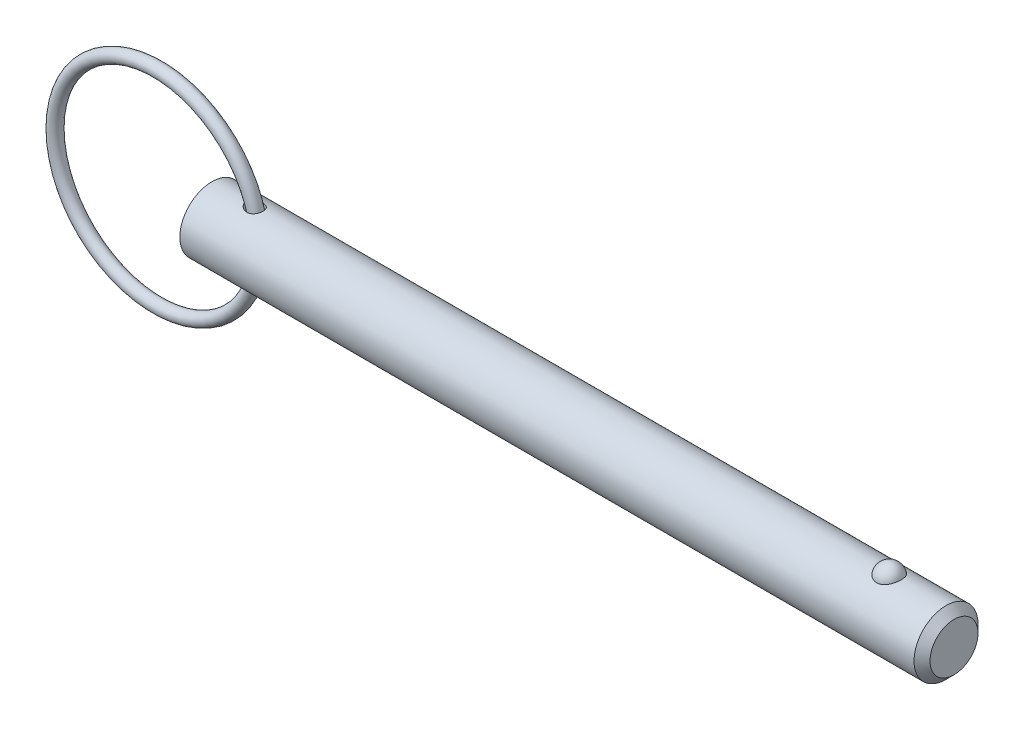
ISO-10303-21;
HEADER;
FILE_DESCRIPTION(('STEP AP214'),'2;1');
FILE_NAME('part.step','',(''),(''),'','','');
FILE_SCHEMA(('AUTOMOTIVE_DESIGN { 1 0 10303 214 1 1 1 1 }'));
ENDSEC;
DATA;
#1=APPLICATION_CONTEXT('core data for automotive mechanical design processes');
#2=APPLICATION_PROTOCOL_DEFINITION('international standard','automotive_design',2000,#1);
#3=PRODUCT_CONTEXT('',#1,'mechanical');
#4=PRODUCT('Part','Part','',(#3));
#5=PRODUCT_RELATED_PRODUCT_CATEGORY('part','',(#4));
#6=PRODUCT_DEFINITION_FORMATION('','',#4);
#7=PRODUCT_DEFINITION_CONTEXT('part definition',#1,'design');
#8=PRODUCT_DEFINITION('design','',#6,#7);
#9=PRODUCT_DEFINITION_SHAPE('','',#8);
#10=(LENGTH_UNIT() NAMED_UNIT(*) SI_UNIT(.MILLI.,.METRE.));
#11=(NAMED_UNIT(*) PLANE_ANGLE_UNIT() SI_UNIT($,.RADIAN.));
#12=(NAMED_UNIT(*) SI_UNIT($,.STERADIAN.) SOLID_ANGLE_UNIT());
#13=UNCERTAINTY_MEASURE_WITH_UNIT(LENGTH_MEASURE(1.E-05),#10,'distance_accuracy_value','');
#14=(GEOMETRIC_REPRESENTATION_CONTEXT(3) GLOBAL_UNCERTAINTY_ASSIGNED_CONTEXT((#13)) GLOBAL_UNIT_ASSIGNED_CONTEXT((#10,
#11,#12)) REPRESENTATION_CONTEXT('',''));
#15=CARTESIAN_POINT('',(0.,0.,0.));
#16=DIRECTION('',(0.,0.,1.));
#17=DIRECTION('',(1.,0.,0.));
#18=AXIS2_PLACEMENT_3D('',#15,#16,#17);
#19=CARTESIAN_POINT('',(-6.75433730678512,0.,0.));
#20=DIRECTION('',(0.,0.,1.));
#21=DIRECTION('',(1.,0.,0.));
#22=AXIS2_PLACEMENT_3D('',#19,#20,#21);
#23=TOROIDAL_SURFACE('',#22,12.7,0.794);
#24=CARTESIAN_POINT('',(6.73966269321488,0.,0.));
#25=VERTEX_POINT('',#24);
#26=VERTEX_LOOP('',#25);
#27=FACE_BOUND('',#26,.T.);
#28=ADVANCED_FACE('P0_F12',(#27),#23,.T.);
#29=CLOSED_SHELL('',(#28));
#30=MANIFOLD_SOLID_BREP('P0_B1',#29);
#31=CARTESIAN_POINT('',(0.,0.,0.));
#32=DIRECTION('',(1.,0.,0.));
#33=DIRECTION('',(0.,0.,-1.));
#34=AXIS2_PLACEMENT_3D('',#31,#32,#33);
#35=CYLINDRICAL_SURFACE('',#34,3.97);
#36=CARTESIAN_POINT('',(4.47423598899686,3.9272127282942,-0.581291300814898));
#37=CARTESIAN_POINT('',(4.51402362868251,3.92000695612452,-0.62997219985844));
#38=CARTESIAN_POINT('',(4.55825642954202,3.91241085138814,-0.675032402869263));
#39=CARTESIAN_POINT('',(4.65378532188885,3.8973704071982,-0.757069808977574));
#40=CARTESIAN_POINT('',(4.70509780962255,3.88992646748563,-0.794027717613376));
#41=CARTESIAN_POINT('',(4.81300878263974,3.87608600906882,-0.859045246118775));
#42=CARTESIAN_POINT('',(4.86959180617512,3.86968656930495,-0.887129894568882));
#43=CARTESIAN_POINT('',(4.98666757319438,3.85867771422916,-0.933854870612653));
#44=CARTESIAN_POINT('',(5.04715829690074,3.85406738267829,-0.952500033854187));
#45=CARTESIAN_POINT('',(5.17222686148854,3.84716625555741,-0.980011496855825));
#46=CARTESIAN_POINT('',(5.23687124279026,3.84494236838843,-0.988596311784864));
#47=CARTESIAN_POINT('',(5.36671178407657,3.84347581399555,-0.994286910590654));
#48=CARTESIAN_POINT('',(5.43190770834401,3.84423193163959,-0.991397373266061));
#49=CARTESIAN_POINT('',(5.5560514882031,3.84859691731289,-0.974304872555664));
#50=CARTESIAN_POINT('',(5.61511712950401,3.85200226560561,-0.960908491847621));
#51=CARTESIAN_POINT('',(5.72974412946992,3.8610605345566,-0.923836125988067));
#52=CARTESIAN_POINT('',(5.78530708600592,3.86671242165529,-0.90016486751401));
#53=CARTESIAN_POINT('',(5.88712740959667,3.87908259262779,-0.845190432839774));
#54=CARTESIAN_POINT('',(5.93376792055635,3.88569301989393,-0.814569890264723));
#55=CARTESIAN_POINT('',(6.02101503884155,3.89947732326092,-0.745789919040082));
#56=CARTESIAN_POINT('',(6.06162229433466,3.90665113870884,-0.707631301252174));
#57=CARTESIAN_POINT('',(6.13496290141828,3.9206013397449,-0.625680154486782));
#58=CARTESIAN_POINT('',(6.16783367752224,3.92738273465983,-0.582011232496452));
#59=CARTESIAN_POINT('',(6.2258925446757,3.93995609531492,-0.489706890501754));
#60=CARTESIAN_POINT('',(6.25108046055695,3.94574803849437,-0.441071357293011));
#61=CARTESIAN_POINT('',(6.29336449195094,3.95576358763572,-0.339770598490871));
#62=CARTESIAN_POINT('',(6.31039150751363,3.95997373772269,-0.28707520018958));
#63=CARTESIAN_POINT('',(6.33565624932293,3.96630600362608,-0.179496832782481));
#64=CARTESIAN_POINT('',(6.34389366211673,3.96842804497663,-0.124613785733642));
#65=CARTESIAN_POINT('',(6.35142037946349,3.97036465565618,-0.0138440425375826));
#66=CARTESIAN_POINT('',(6.35065227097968,3.97016441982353,0.0420468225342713));
#67=CARTESIAN_POINT('',(6.34004566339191,3.96744188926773,0.152904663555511));
#68=CARTESIAN_POINT('',(6.33020697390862,3.96491954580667,0.207871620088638));
#69=CARTESIAN_POINT('',(6.30166659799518,3.95782104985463,0.315369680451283));
#70=CARTESIAN_POINT('',(6.28295698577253,3.95324306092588,0.36789855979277));
#71=CARTESIAN_POINT('',(6.23710200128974,3.94253162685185,0.468965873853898));
#72=CARTESIAN_POINT('',(6.20995670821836,3.93639819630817,0.517504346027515));
#73=CARTESIAN_POINT('',(6.14798638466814,3.92327702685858,0.609041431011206));
#74=CARTESIAN_POINT('',(6.11318666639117,3.91629213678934,0.652057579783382));
#75=CARTESIAN_POINT('',(6.03675089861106,3.90223639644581,0.731492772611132));
#76=CARTESIAN_POINT('',(5.99511563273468,3.89516555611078,0.767912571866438));
#77=CARTESIAN_POINT('',(5.90657479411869,3.88180215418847,0.832828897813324));
#78=CARTESIAN_POINT('',(5.85972260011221,3.87550288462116,0.86139687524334));
#79=CARTESIAN_POINT('',(5.76177854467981,3.86429747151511,0.910350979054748));
#80=CARTESIAN_POINT('',(5.71068697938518,3.8593912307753,0.930737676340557));
#81=CARTESIAN_POINT('',(5.60571987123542,3.85147434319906,0.962976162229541));
#82=CARTESIAN_POINT('',(5.55184284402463,3.84846471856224,0.974823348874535));
#83=CARTESIAN_POINT('',(5.44283210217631,3.84460058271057,0.989953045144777));
#84=CARTESIAN_POINT('',(5.38769814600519,3.84374648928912,0.99323389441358));
#85=CARTESIAN_POINT('',(5.27524330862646,3.84420584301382,0.991454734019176));
#86=CARTESIAN_POINT('',(5.21792896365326,3.84561285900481,0.986034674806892));
#87=CARTESIAN_POINT('',(5.1048579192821,3.85052758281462,0.966661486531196));
#88=CARTESIAN_POINT('',(5.04910180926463,3.85403607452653,0.952705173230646));
#89=CARTESIAN_POINT('',(4.93593174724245,3.86308835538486,0.915340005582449));
#90=CARTESIAN_POINT('',(4.8787523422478,3.86877458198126,0.891254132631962));
#91=CARTESIAN_POINT('',(4.7690169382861,3.88143650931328,0.83438431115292));
#92=CARTESIAN_POINT('',(4.71646372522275,3.88841297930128,0.801595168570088));
#93=CARTESIAN_POINT('',(4.61492504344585,3.90324173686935,0.726056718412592));
#94=CARTESIAN_POINT('',(4.56625259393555,3.91112043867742,0.682888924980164));
#95=CARTESIAN_POINT('',(4.47749220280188,3.92644930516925,0.588370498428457));
#96=CARTESIAN_POINT('',(4.43740132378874,3.93389961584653,0.537022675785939));
#97=CARTESIAN_POINT('',(4.37035516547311,3.94686586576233,0.431042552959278));
#98=CARTESIAN_POINT('',(4.34268823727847,3.95247934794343,0.376876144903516));
#99=CARTESIAN_POINT('',(4.29855851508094,3.96161331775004,0.264011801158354));
#100=CARTESIAN_POINT('',(4.28207681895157,3.96513733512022,0.20532169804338));
#101=CARTESIAN_POINT('',(4.26319409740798,3.96919493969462,0.094762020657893));
#102=CARTESIAN_POINT('',(4.25904206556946,3.97009986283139,0.0432014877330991));
#103=CARTESIAN_POINT('',(4.26004223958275,3.9698827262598,-0.0598293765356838));
#104=CARTESIAN_POINT('',(4.26519288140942,3.96876100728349,-0.111299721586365));
#105=CARTESIAN_POINT('',(4.28369027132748,3.96479623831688,-0.208517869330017));
#106=CARTESIAN_POINT('',(4.29637416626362,3.96209263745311,-0.25440084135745));
#107=CARTESIAN_POINT('',(4.32867922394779,3.95536287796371,-0.343510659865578));
#108=CARTESIAN_POINT('',(4.34829584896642,3.95133758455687,-0.386739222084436));
#109=CARTESIAN_POINT('',(4.38573190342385,3.94389838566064,-0.455314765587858));
#110=CARTESIAN_POINT('',(4.40181371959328,3.94075686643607,-0.481662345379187));
#111=CARTESIAN_POINT('',(4.43632024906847,3.93417901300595,-0.532726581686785));
#112=CARTESIAN_POINT('',(4.45474473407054,3.93074270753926,-0.557443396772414));
#113=CARTESIAN_POINT('',(4.47423598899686,3.9272127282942,-0.581291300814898));
#114=B_SPLINE_CURVE_WITH_KNOTS('',3,(#36,#37,#38,#39,#40,#41,#42,#43,#44,#45,#46,#47,#48,#49,
#50,#51,#52,#53,#54,#55,#56,#57,#58,#59,#60,#61,#62,#63,#64,#65,#66,#67,#68,#69,#70,#71,#72,#73,
#74,#75,#76,#77,#78,#79,#80,#81,#82,#83,#84,#85,#86,#87,#88,#89,#90,#91,#92,#93,#94,#95,#96,#97,
#98,#99,#100,#101,#102,#103,#104,#105,#106,#107,#108,#109,#110,#111,#112,#113),.UNSPECIFIED.,
.T.,.F.,(4,2,2,2,2,2,2,2,2,2,2,2,2,2,2,2,2,2,2,2,2,2,2,2,2,2,2,2,2,2,2,2,2,2,2,2,2,2,4),(0.,
0.189730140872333,0.379907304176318,0.569543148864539,0.759081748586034,0.953805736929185,
1.148450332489,1.32946176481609,1.51039001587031,1.67812095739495,1.84583386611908,
2.01029437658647,2.17475863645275,2.34059186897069,2.50643101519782,2.67332801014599,
2.84022850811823,3.00727840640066,3.17432673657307,3.34083074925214,3.50731568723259,
3.67223129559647,3.83713539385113,4.00212829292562,4.16715316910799,4.33918465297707,
4.5112803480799,4.69738596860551,4.88360290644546,5.07919911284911,5.27472826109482,
5.45686425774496,5.63869168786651,5.79305070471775,5.94738377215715,6.08981233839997,
6.2321478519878,6.3251023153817,6.4180477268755),.UNSPECIFIED.);
#115=CARTESIAN_POINT('',(4.47423598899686,3.9272127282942,-0.581291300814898));
#116=VERTEX_POINT('',#115);
#117=EDGE_CURVE('P1_E40',#116,#116,#114,.T.);
#118=ORIENTED_EDGE('',*,*,#117,.T.);
#119=EDGE_LOOP('',(#118));
#120=FACE_BOUND('',#119,.T.);
#121=CARTESIAN_POINT('',(91.0875,0.,0.));
#122=DIRECTION('',(1.,0.,0.));
#123=DIRECTION('',(0.,0.,-1.));
#124=AXIS2_PLACEMENT_3D('',#121,#122,#123);
#125=CIRCLE('',#124,3.97);
#126=CARTESIAN_POINT('',(91.0875,0.,-3.97));
#127=VERTEX_POINT('',#126);
#128=EDGE_CURVE('P1_E25',#127,#127,#125,.T.);
#129=ORIENTED_EDGE('',*,*,#128,.F.);
#130=EDGE_LOOP('',(#129));
#131=FACE_BOUND('',#130,.T.);
#132=CARTESIAN_POINT('',(0.,0.,0.));
#133=DIRECTION('',(1.,0.,0.));
#134=DIRECTION('',(0.,0.,-1.));
#135=AXIS2_PLACEMENT_3D('',#132,#133,#134);
#136=CIRCLE('',#135,3.97);
#137=CARTESIAN_POINT('',(0.,0.,-3.97));
#138=VERTEX_POINT('',#137);
#139=EDGE_CURVE('P1_E9',#138,#138,#136,.T.);
#140=ORIENTED_EDGE('',*,*,#139,.T.);
#141=EDGE_LOOP('',(#140));
#142=FACE_BOUND('',#141,.T.);
#143=CARTESIAN_POINT('',(84.0451922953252,3.65715365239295,1.54470941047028));
#144=CARTESIAN_POINT('',(83.9652448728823,3.65716001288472,1.54470290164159));
#145=CARTESIAN_POINT('',(83.8851650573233,3.65987074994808,1.53832549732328));
#146=CARTESIAN_POINT('',(83.7272374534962,3.6704221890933,1.51297018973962));
#147=CARTESIAN_POINT('',(83.6493961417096,3.67827646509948,1.49395894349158));
#148=CARTESIAN_POINT('',(83.4984614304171,3.69818848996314,1.44395950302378));
#149=CARTESIAN_POINT('',(83.4253560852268,3.71023513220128,1.41300293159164));
#150=CARTESIAN_POINT('',(83.2855630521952,3.73721833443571,1.34000212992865));
#151=CARTESIAN_POINT('',(83.2188725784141,3.75215363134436,1.2979627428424));
#152=CARTESIAN_POINT('',(83.0914886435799,3.78384968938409,1.20248834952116));
#153=CARTESIAN_POINT('',(83.0310299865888,3.80065129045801,1.14875388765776));
#154=CARTESIAN_POINT('',(82.9196942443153,3.83398532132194,1.03205417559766));
#155=CARTESIAN_POINT('',(82.8688200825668,3.85051766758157,0.969086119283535));
#156=CARTESIAN_POINT('',(82.7756321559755,3.88238608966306,0.832526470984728));
#157=CARTESIAN_POINT('',(82.7337961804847,3.89763698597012,0.758588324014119));
#158=CARTESIAN_POINT('',(82.6625108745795,3.92451063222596,0.604352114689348));
#159=CARTESIAN_POINT('',(82.6330623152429,3.93613315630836,0.524053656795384));
#160=CARTESIAN_POINT('',(82.5868927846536,3.95467606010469,0.35840348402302));
#161=CARTESIAN_POINT('',(82.5703127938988,3.96154426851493,0.273006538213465));
#162=CARTESIAN_POINT('',(82.550756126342,3.96967008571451,0.100408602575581));
#163=CARTESIAN_POINT('',(82.5477789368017,3.97092790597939,0.0132076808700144));
#164=CARTESIAN_POINT('',(82.5554587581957,3.96771794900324,-0.159844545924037));
#165=CARTESIAN_POINT('',(82.5660164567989,3.96329187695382,-0.245701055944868));
#166=CARTESIAN_POINT('',(82.6003800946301,3.94923163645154,-0.41427746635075));
#167=CARTESIAN_POINT('',(82.6241862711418,3.93959737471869,-0.496997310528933));
#168=CARTESIAN_POINT('',(82.6846114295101,3.91607752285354,-0.657113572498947));
#169=CARTESIAN_POINT('',(82.7212495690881,3.90218558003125,-0.734501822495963));
#170=CARTESIAN_POINT('',(82.8065935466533,3.87158287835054,-0.881704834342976));
#171=CARTESIAN_POINT('',(82.8553004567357,3.8548718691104,-0.95151892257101));
#172=CARTESIAN_POINT('',(82.9641161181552,3.82028735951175,-1.08208159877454));
#173=CARTESIAN_POINT('',(83.0242955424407,3.80240713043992,-1.14276958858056));
#174=CARTESIAN_POINT('',(83.154493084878,3.76758161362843,-1.2528243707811));
#175=CARTESIAN_POINT('',(83.2245105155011,3.75063626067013,-1.30219195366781));
#176=CARTESIAN_POINT('',(83.37118160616,3.71998948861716,-1.38729709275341));
#177=CARTESIAN_POINT('',(83.4476813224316,3.70623183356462,-1.42327904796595));
#178=CARTESIAN_POINT('',(83.6062981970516,3.68323188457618,-1.48178996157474));
#179=CARTESIAN_POINT('',(83.6884132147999,3.67398788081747,-1.5043240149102));
#180=CARTESIAN_POINT('',(83.8514810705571,3.6615216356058,-1.53440939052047));
#181=CARTESIAN_POINT('',(83.9322840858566,3.65801951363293,-1.54265826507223));
#182=CARTESIAN_POINT('',(84.0942085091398,3.65657341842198,-1.54608423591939));
#183=CARTESIAN_POINT('',(84.1753298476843,3.65862829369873,-1.54126404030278));
#184=CARTESIAN_POINT('',(84.3328122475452,3.66788969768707,-1.51908474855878));
#185=CARTESIAN_POINT('',(84.4092422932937,3.67492621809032,-1.50213925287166));
#186=CARTESIAN_POINT('',(84.5580412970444,3.6931840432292,-1.45666982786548));
#187=CARTESIAN_POINT('',(84.6304099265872,3.70440568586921,-1.42814496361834));
#188=CARTESIAN_POINT('',(84.7708029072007,3.73012749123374,-1.35956319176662));
#189=CARTESIAN_POINT('',(84.8387000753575,3.74469307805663,-1.31927107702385));
#190=CARTESIAN_POINT('',(84.9668649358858,3.77545272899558,-1.22847440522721));
#191=CARTESIAN_POINT('',(85.0271308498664,3.79164717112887,-1.17796747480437));
#192=CARTESIAN_POINT('',(85.1416346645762,3.82490325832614,-1.06519260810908));
#193=CARTESIAN_POINT('',(85.1954137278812,3.84196735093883,-1.00245914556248));
#194=CARTESIAN_POINT('',(85.2920988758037,3.87439863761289,-0.868715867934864));
#195=CARTESIAN_POINT('',(85.3350030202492,3.88976552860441,-0.797704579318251));
#196=CARTESIAN_POINT('',(85.410266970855,3.91771381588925,-0.646896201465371));
#197=CARTESIAN_POINT('',(85.4422532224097,3.93019255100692,-0.566893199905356));
#198=CARTESIAN_POINT('',(85.4931101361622,3.95043886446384,-0.402255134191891));
#199=CARTESIAN_POINT('',(85.5119807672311,3.95820643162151,-0.317620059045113));
#200=CARTESIAN_POINT('',(85.5362162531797,3.96823733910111,-0.146156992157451));
#201=CARTESIAN_POINT('',(85.5415874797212,3.970503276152,-0.0593300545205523));
#202=CARTESIAN_POINT('',(85.5387309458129,3.96930811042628,0.114057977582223));
#203=CARTESIAN_POINT('',(85.530503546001,3.9658471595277,0.200619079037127));
#204=CARTESIAN_POINT('',(85.5007063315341,3.95358562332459,0.370506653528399));
#205=CARTESIAN_POINT('',(85.4792129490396,3.94481563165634,0.453848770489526));
#206=CARTESIAN_POINT('',(85.4233839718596,3.92284586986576,0.615497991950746));
#207=CARTESIAN_POINT('',(85.3890474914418,3.90964579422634,0.693804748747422));
#208=CARTESIAN_POINT('',(85.3079702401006,3.88006987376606,0.843703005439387));
#209=CARTESIAN_POINT('',(85.2611536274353,3.86367478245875,0.915249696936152));
#210=CARTESIAN_POINT('',(85.1561897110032,3.82949741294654,1.04910810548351));
#211=CARTESIAN_POINT('',(85.0980428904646,3.81171519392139,1.11142021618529));
#212=CARTESIAN_POINT('',(84.9717433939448,3.77673366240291,1.22503948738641));
#213=CARTESIAN_POINT('',(84.9035970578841,3.75953398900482,1.27635357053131));
#214=CARTESIAN_POINT('',(84.7589009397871,3.72770506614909,1.36653336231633));
#215=CARTESIAN_POINT('',(84.682348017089,3.71307678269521,1.40539439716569));
#216=CARTESIAN_POINT('',(84.5257594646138,3.68864287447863,1.46830480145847));
#217=CARTESIAN_POINT('',(84.4459307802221,3.67869017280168,1.49281289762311));
#218=CARTESIAN_POINT('',(84.2829877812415,3.66414535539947,1.52817474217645));
#219=CARTESIAN_POINT('',(84.1998840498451,3.65953723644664,1.53906926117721));
#220=CARTESIAN_POINT('',(84.0927760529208,3.6573894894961,1.54414878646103));
#221=CARTESIAN_POINT('',(84.0689900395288,3.65715175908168,1.54471134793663));
#222=CARTESIAN_POINT('',(84.0451922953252,3.65715365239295,1.54470941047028));
#223=B_SPLINE_CURVE_WITH_KNOTS('',3,(#143,#144,#145,#146,#147,#148,#149,#150,#151,#152,#153,
#154,#155,#156,#157,#158,#159,#160,#161,#162,#163,#164,#165,#166,#167,#168,#169,#170,#171,#172,
#173,#174,#175,#176,#177,#178,#179,#180,#181,#182,#183,#184,#185,#186,#187,#188,#189,#190,#191,
#192,#193,#194,#195,#196,#197,#198,#199,#200,#201,#202,#203,#204,#205,#206,#207,#208,#209,#210,
#211,#212,#213,#214,#215,#216,#217,#218,#219,#220,#221,#222),.UNSPECIFIED.,.T.,.F.,(4,2,2,2,2,2,
2,2,2,2,2,2,2,2,2,2,2,2,2,2,2,2,2,2,2,2,2,2,2,2,2,2,2,2,2,2,2,2,2,4),(0.,0.239777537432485,
0.480190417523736,0.719971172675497,0.959647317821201,1.20639040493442,1.45320863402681,
1.7109367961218,1.96868099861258,2.22921052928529,2.48973023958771,2.74834928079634,
3.00697295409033,3.26598440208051,3.52501886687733,3.78570385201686,4.04637062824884,
4.3020125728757,4.55755760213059,4.80022994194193,5.04285200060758,5.27757006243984,
5.51230707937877,5.75210128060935,5.99195126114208,6.24392810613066,6.49594987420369,
6.75588818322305,7.01582710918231,7.27564332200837,7.53545264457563,7.79377886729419,
8.0521229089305,8.31207418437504,8.57201437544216,8.83179046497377,9.09166393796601,
9.34270057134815,9.59298357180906,9.66435753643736),.UNSPECIFIED.);
#224=CARTESIAN_POINT('',(84.0451922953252,3.65715365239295,1.54470941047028));
#225=VERTEX_POINT('',#224);
#226=EDGE_CURVE('P1_E34',#225,#225,#223,.T.);
#227=ORIENTED_EDGE('',*,*,#226,.T.);
#228=EDGE_LOOP('',(#227));
#229=FACE_BOUND('',#228,.T.);
#230=CARTESIAN_POINT('',(4.47423598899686,-3.9272127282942,-0.581291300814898));
#231=CARTESIAN_POINT('',(4.44128910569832,-3.93317954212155,-0.540978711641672));
#232=CARTESIAN_POINT('',(4.41136828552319,-3.93888228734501,-0.498159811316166));
#233=CARTESIAN_POINT('',(4.35872676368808,-3.94921939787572,-0.408179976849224));
#234=CARTESIAN_POINT('',(4.33600082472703,-3.95385453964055,-0.36102223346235));
#235=CARTESIAN_POINT('',(4.29878526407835,-3.9615772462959,-0.263108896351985));
#236=CARTESIAN_POINT('',(4.28434166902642,-3.96465615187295,-0.212334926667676));
#237=CARTESIAN_POINT('',(4.26481927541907,-3.96884157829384,-0.108934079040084));
#238=CARTESIAN_POINT('',(4.25973608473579,-3.96994902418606,-0.0563080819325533));
#239=CARTESIAN_POINT('',(4.25930094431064,-3.97004379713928,0.0449240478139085));
#240=CARTESIAN_POINT('',(4.26323134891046,-3.96918747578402,0.0935283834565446));
#241=CARTESIAN_POINT('',(4.27911923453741,-3.96577236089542,0.189336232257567));
#242=CARTESIAN_POINT('',(4.29107713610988,-3.96321347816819,0.236539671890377));
#243=CARTESIAN_POINT('',(4.3222019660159,-3.95670052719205,0.327873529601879));
#244=CARTESIAN_POINT('',(4.34129939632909,-3.95275993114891,0.37202886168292));
#245=CARTESIAN_POINT('',(4.38584298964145,-3.94385347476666,0.456884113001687));
#246=CARTESIAN_POINT('',(4.41129114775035,-3.93888729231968,0.497582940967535));
#247=CARTESIAN_POINT('',(4.47067915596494,-3.92777410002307,0.57910486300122));
#248=CARTESIAN_POINT('',(4.50523982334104,-3.92155746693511,0.61946509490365));
#249=CARTESIAN_POINT('',(4.57989786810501,-3.90894004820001,0.694653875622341));
#250=CARTESIAN_POINT('',(4.61999845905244,-3.90253915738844,0.729479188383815));
#251=CARTESIAN_POINT('',(4.7106931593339,-3.88921622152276,0.79766500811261));
#252=CARTESIAN_POINT('',(4.76196990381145,-3.88234748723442,0.830130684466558));
#253=CARTESIAN_POINT('',(4.86907659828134,-3.86980743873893,0.886754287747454));
#254=CARTESIAN_POINT('',(4.92490895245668,-3.86413676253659,0.91090779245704));
#255=CARTESIAN_POINT('',(5.04387274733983,-3.85430959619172,0.951667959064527));
#256=CARTESIAN_POINT('',(5.10724127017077,-3.85028805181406,0.967622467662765));
#257=CARTESIAN_POINT('',(5.23589558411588,-3.84499084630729,0.988466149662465));
#258=CARTESIAN_POINT('',(5.30118075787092,-3.84371431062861,0.993358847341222));
#259=CARTESIAN_POINT('',(5.42870419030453,-3.84421020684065,0.991437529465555));
#260=CARTESIAN_POINT('',(5.49094970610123,-3.84585050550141,0.985130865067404));
#261=CARTESIAN_POINT('',(5.61317445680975,-3.85182888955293,0.961489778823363));
#262=CARTESIAN_POINT('',(5.67315499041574,-3.85616540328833,0.944161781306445));
#263=CARTESIAN_POINT('',(5.78385047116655,-3.86655540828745,0.900611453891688));
#264=CARTESIAN_POINT('',(5.83492113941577,-3.87243611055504,0.875248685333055));
#265=CARTESIAN_POINT('',(5.93173444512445,-3.88533932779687,0.816058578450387));
#266=CARTESIAN_POINT('',(5.97747806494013,-3.89236163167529,0.78223280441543));
#267=CARTESIAN_POINT('',(6.06067538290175,-3.90644082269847,0.708499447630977));
#268=CARTESIAN_POINT('',(6.09837515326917,-3.9134865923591,0.668866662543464));
#269=CARTESIAN_POINT('',(6.16659675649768,-3.92708124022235,0.583768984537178));
#270=CARTESIAN_POINT('',(6.19711866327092,-3.93363012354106,0.538304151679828));
#271=CARTESIAN_POINT('',(6.25033980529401,-3.94554016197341,0.44265233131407));
#272=CARTESIAN_POINT('',(6.27301093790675,-3.95089702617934,0.392449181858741));
#273=CARTESIAN_POINT('',(6.3098605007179,-3.95981777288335,0.288866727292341));
#274=CARTESIAN_POINT('',(6.32403857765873,-3.96338158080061,0.235487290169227));
#275=CARTESIAN_POINT('',(6.34366897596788,-3.96835894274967,0.126579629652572));
#276=CARTESIAN_POINT('',(6.34904619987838,-3.9697539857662,0.0710370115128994));
#277=CARTESIAN_POINT('',(6.35072157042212,-3.97018611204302,-0.0401947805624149));
#278=CARTESIAN_POINT('',(6.34701950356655,-3.96922313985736,-0.0958839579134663));
#279=CARTESIAN_POINT('',(6.33059893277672,-3.96503727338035,-0.205963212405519));
#280=CARTESIAN_POINT('',(6.31785949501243,-3.96180913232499,-0.260349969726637));
#281=CARTESIAN_POINT('',(6.28362857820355,-3.95343617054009,-0.366141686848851));
#282=CARTESIAN_POINT('',(6.26213701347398,-3.94829133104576,-0.417546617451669));
#283=CARTESIAN_POINT('',(6.21094198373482,-3.93665740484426,-0.515825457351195));
#284=CARTESIAN_POINT('',(6.18125109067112,-3.93017037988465,-0.562706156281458));
#285=CARTESIAN_POINT('',(6.11437296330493,-3.91656890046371,-0.650670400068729));
#286=CARTESIAN_POINT('',(6.07718632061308,-3.90945449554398,-0.691754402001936));
#287=CARTESIAN_POINT('',(5.99660825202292,-3.89545704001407,-0.76665430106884));
#288=CARTESIAN_POINT('',(5.95326700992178,-3.88857262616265,-0.800523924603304));
#289=CARTESIAN_POINT('',(5.86137696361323,-3.87574946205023,-0.860470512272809));
#290=CARTESIAN_POINT('',(5.81282877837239,-3.86981059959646,-0.886548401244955));
#291=CARTESIAN_POINT('',(5.71225875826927,-3.85955823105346,-0.93016771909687));
#292=CARTESIAN_POINT('',(5.6602610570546,-3.85523459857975,-0.947762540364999));
#293=CARTESIAN_POINT('',(5.55400860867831,-3.84858369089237,-0.974419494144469));
#294=CARTESIAN_POINT('',(5.49975362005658,-3.84625662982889,-0.983480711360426));
#295=CARTESIAN_POINT('',(5.38905619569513,-3.84373902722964,-0.99327593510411));
#296=CARTESIAN_POINT('',(5.33259335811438,-3.8436048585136,-0.993790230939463));
#297=CARTESIAN_POINT('',(5.22028568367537,-3.84553679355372,-0.986285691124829));
#298=CARTESIAN_POINT('',(5.16444101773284,-3.84760349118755,-0.978264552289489));
#299=CARTESIAN_POINT('',(5.05063804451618,-3.85386728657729,-0.953301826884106));
#300=CARTESIAN_POINT('',(4.99282059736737,-3.85820814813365,-0.935754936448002));
#301=CARTESIAN_POINT('',(4.88067115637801,-3.86855108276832,-0.89202836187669));
#302=CARTESIAN_POINT('',(4.82634209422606,-3.87455453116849,-0.865841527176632));
#303=CARTESIAN_POINT('',(4.71735796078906,-3.8882057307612,-0.802439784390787));
#304=CARTESIAN_POINT('',(4.66319676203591,-3.89595714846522,-0.764393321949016));
#305=CARTESIAN_POINT('',(4.5624904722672,-3.9116844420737,-0.679328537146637));
#306=CARTESIAN_POINT('',(4.51593909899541,-3.9196601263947,-0.632317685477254));
#307=CARTESIAN_POINT('',(4.47423598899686,-3.9272127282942,-0.581291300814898));
#308=B_SPLINE_CURVE_WITH_KNOTS('',3,(#230,#231,#232,#233,#234,#235,#236,#237,#238,#239,#240,
#241,#242,#243,#244,#245,#246,#247,#248,#249,#250,#251,#252,#253,#254,#255,#256,#257,#258,#259,
#260,#261,#262,#263,#264,#265,#266,#267,#268,#269,#270,#271,#272,#273,#274,#275,#276,#277,#278,
#279,#280,#281,#282,#283,#284,#285,#286,#287,#288,#289,#290,#291,#292,#293,#294,#295,#296,#297,
#298,#299,#300,#301,#302,#303,#304,#305,#306,#307),.UNSPECIFIED.,.T.,.F.,(4,2,2,2,2,2,2,2,2,2,2,
2,2,2,2,2,2,2,2,2,2,2,2,2,2,2,2,2,2,2,2,2,2,2,2,2,2,2,4),(0.,0.157032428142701,
0.313950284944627,0.47173191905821,0.629439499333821,0.775030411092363,0.920628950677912,
1.06484561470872,1.20910764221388,1.36897610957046,1.5289377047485,1.71139614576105,
1.89395150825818,2.08937788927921,2.28474199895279,2.4714801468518,2.65810954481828,
2.82921764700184,3.00029414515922,3.16497190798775,3.32964797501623,3.49490756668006,
3.66017403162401,3.82684349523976,3.99351687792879,4.16057760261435,4.3276399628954,
4.49444757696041,4.66124203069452,4.82674719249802,4.99223270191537,5.15666259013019,
5.32111011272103,5.48977863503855,5.6584926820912,5.83945443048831,6.02056632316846,
6.21949800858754,6.41826462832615),.UNSPECIFIED.);
#309=CARTESIAN_POINT('',(4.47423598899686,-3.9272127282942,-0.581291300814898));
#310=VERTEX_POINT('',#309);
#311=EDGE_CURVE('P1_E17',#310,#310,#308,.T.);
#312=ORIENTED_EDGE('',*,*,#311,.T.);
#313=EDGE_LOOP('',(#312));
#314=FACE_BOUND('',#313,.T.);
#315=ADVANCED_FACE('P1_F13',(#120,#131,#142,#229,#314),#35,.T.);
#316=CARTESIAN_POINT('',(0.,0.,0.));
#317=DIRECTION('',(-1.,0.,0.));
#318=DIRECTION('',(0.,0.,1.));
#319=AXIS2_PLACEMENT_3D('',#316,#317,#318);
#320=PLANE('',#319);
#321=ORIENTED_EDGE('',*,*,#139,.F.);
#322=EDGE_LOOP('',(#321));
#323=FACE_BOUND('',#322,.T.);
#324=ADVANCED_FACE('P1_F15',(#323),#320,.T.);
#325=CARTESIAN_POINT('',(92.08,0.,0.));
#326=DIRECTION('',(-1.,0.,0.));
#327=DIRECTION('',(0.,0.,1.));
#328=AXIS2_PLACEMENT_3D('',#325,#326,#327);
#329=CONICAL_SURFACE('',#328,2.97750000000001,0.785398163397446);
#330=ORIENTED_EDGE('',*,*,#128,.T.);
#331=EDGE_LOOP('',(#330));
#332=FACE_BOUND('',#331,.T.);
#333=CARTESIAN_POINT('',(92.08,0.,0.));
#334=DIRECTION('',(1.,0.,0.));
#335=DIRECTION('',(0.,0.,-1.));
#336=AXIS2_PLACEMENT_3D('',#333,#334,#335);
#337=CIRCLE('',#336,2.97750000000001);
#338=CARTESIAN_POINT('',(92.08,0.,-2.97750000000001));
#339=VERTEX_POINT('',#338);
#340=EDGE_CURVE('P1_E30',#339,#339,#337,.T.);
#341=ORIENTED_EDGE('',*,*,#340,.F.);
#342=EDGE_LOOP('',(#341));
#343=FACE_BOUND('',#342,.T.);
#344=ADVANCED_FACE('P1_F55',(#332,#343),#329,.T.);
#345=CARTESIAN_POINT('',(92.08,2.97750000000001,0.));
#346=DIRECTION('',(1.,0.,0.));
#347=DIRECTION('',(0.,0.,-1.));
#348=AXIS2_PLACEMENT_3D('',#345,#346,#347);
#349=PLANE('',#348);
#350=ORIENTED_EDGE('',*,*,#340,.T.);
#351=EDGE_LOOP('',(#350));
#352=FACE_BOUND('',#351,.T.);
#353=ADVANCED_FACE('P1_F51',(#352),#349,.T.);
#354=CARTESIAN_POINT('',(84.0451922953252,3.573,0.));
#355=DIRECTION('',(-1.,0.,0.));
#356=DIRECTION('',(0.,1.,0.));
#357=AXIS2_PLACEMENT_3D('',#354,#355,#356);
#358=SPHERICAL_SURFACE('',#357,1.54699999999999);
#359=ORIENTED_EDGE('',*,*,#226,.F.);
#360=EDGE_LOOP('',(#359));
#361=FACE_BOUND('',#360,.T.);
#362=ADVANCED_FACE('P1_F46',(#361),#358,.T.);
#363=CARTESIAN_POINT('',(-6.75433730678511,0.,0.));
#364=DIRECTION('',(0.,0.,1.));
#365=DIRECTION('',(1.,0.,0.));
#366=AXIS2_PLACEMENT_3D('',#363,#364,#365);
#367=TOROIDAL_SURFACE('',#366,12.7,0.9925);
#368=ORIENTED_EDGE('',*,*,#311,.F.);
#369=EDGE_LOOP('',(#368));
#370=FACE_BOUND('',#369,.T.);
#371=ORIENTED_EDGE('',*,*,#117,.F.);
#372=EDGE_LOOP('',(#371));
#373=FACE_BOUND('',#372,.T.);
#374=ADVANCED_FACE('P1_F50',(#370,#373),#367,.F.);
#375=CLOSED_SHELL('',(#315,#324,#344,#353,#362,#374));
#376=MANIFOLD_SOLID_BREP('P1_B1',#375);
#377=ADVANCED_BREP_SHAPE_REPRESENTATION('',(#18,#30,#376),#14);
#378=SHAPE_DEFINITION_REPRESENTATION(#9,#377);
ENDSEC;
END-ISO-10303-21;
